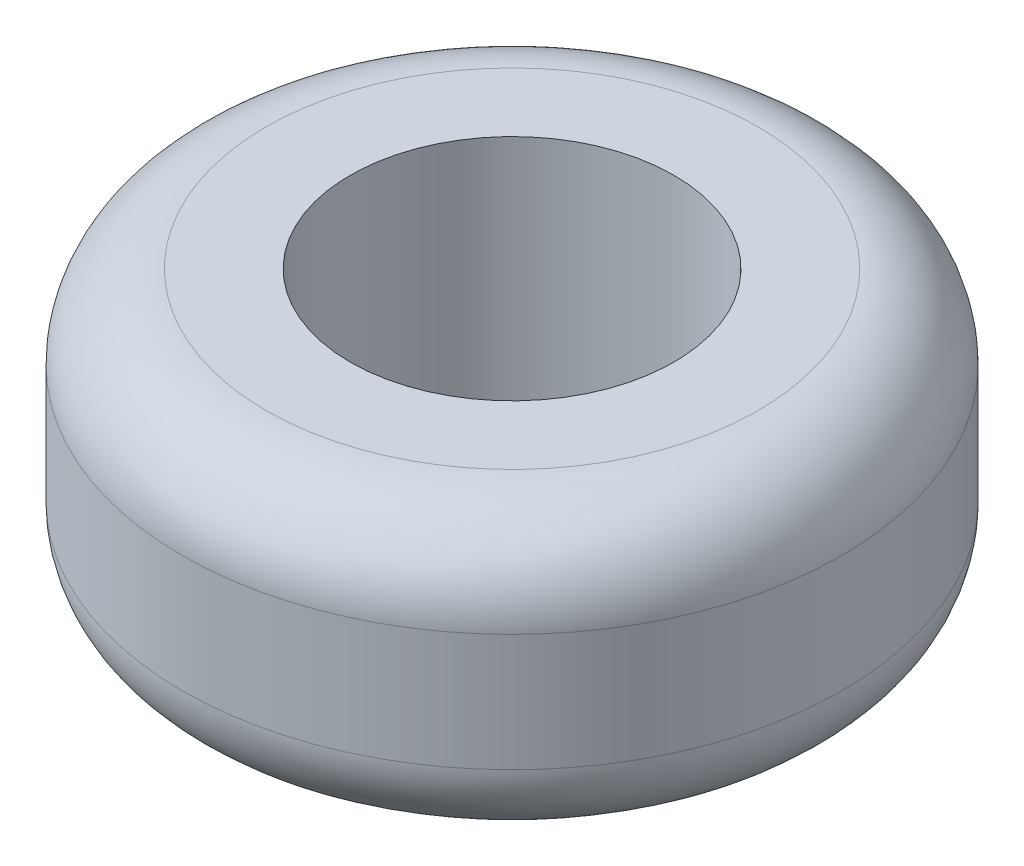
from build123d import *

# Parameters (mm, degrees)
SKETCH1_R           = 12.5015625
SKETCH1_R_2         = 6.14045
BOSS_EXTRUDE1_DEPTH = 10.795
FILLET1_R           = 3.175


with BuildPart() as part:
    # Sketch1 → Boss-Extrude1 (new body)
    with BuildSketch(Plane(origin=(0, 0, 0), x_dir=(1, 0, 0), z_dir=(0, 1, 0))):
        with Locations(Location((0, 0, 0), (0, 0, 270))):
            Circle(SKETCH1_R)
        with Locations(Location((0, 0, 0), (0, 0, 270))):
            Circle(SKETCH1_R_2, mode=Mode.SUBTRACT)
    extrude(amount=BOSS_EXTRUDE1_DEPTH)

    # Fillet1
    fillet1_edges = [part.edges().sort_by_distance(p)[0] for p in [
        (0, 0, -12.5015625),
        (0, 10.795, -12.5015625),
    ]]
    fillet(fillet1_edges, radius=FILLET1_R)


solid = part.part
